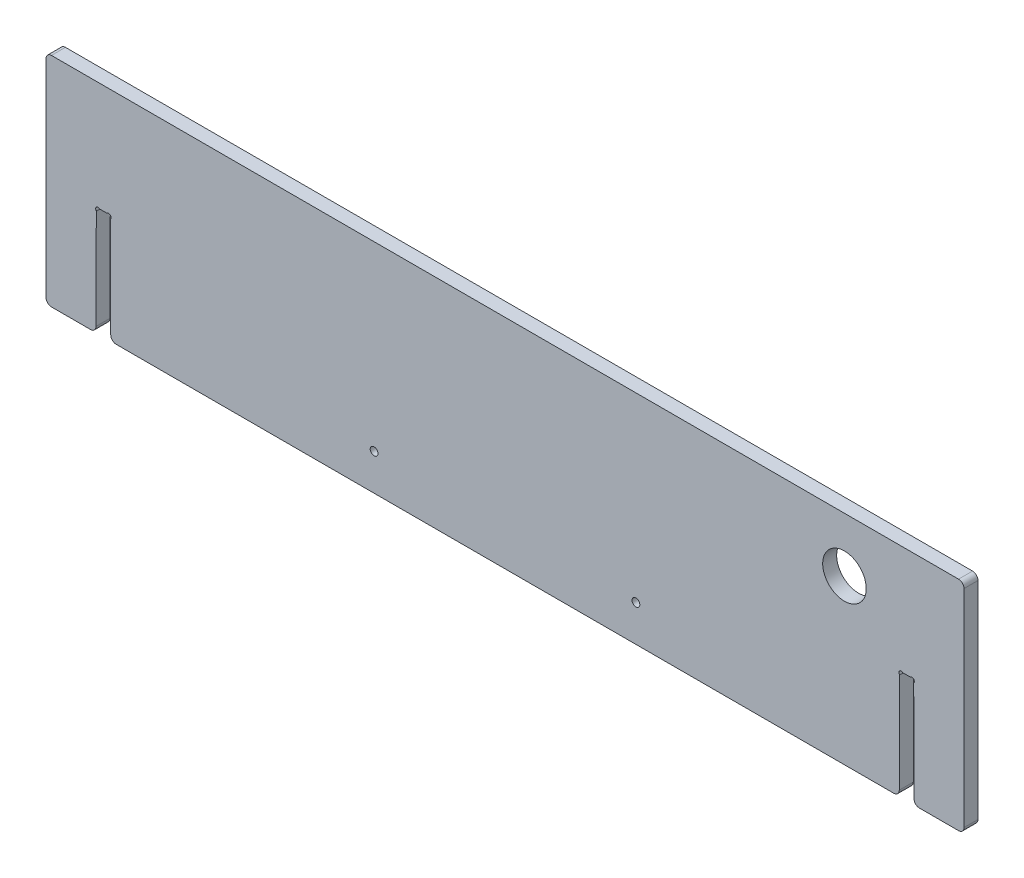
from build123d import *

# Parameters (mm, degrees)
ESQUISSE1_W         = 590.5
ESQUISSE1_H         = 280.25
BOSS_EXTRUDE1_DEPTH = 18
CUT_EXTRUDE1_DEPTH  = 654.876374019
ESQUISSE3_R         = 5
CUT_EXTRUDE2_DEPTH  = 654.876374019
CONG_1_R            = 7
SKETCH1_R           = 28
CUT_EXTRUDE3_DEPTH  = 1214.929595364


with BuildPart() as part:
    # Esquisse1 → Boss-Extrude1 (new body)
    with BuildSketch(Plane.XY):
        with Locations((295.25, 140.125)):
            Rectangle(ESQUISSE1_W, ESQUISSE1_H)
    extrude(amount=BOSS_EXTRUDE1_DEPTH)

    # Esquisse2 → Cut-Extrude1 (cut, through all)
    with BuildSketch(Plane.XY.offset(18)):
        with BuildLine():
            Line((69.477649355, 140.125), (78.147350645, 140.125))
            ThreePointArc((78.147350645, 140.125), (78.480108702, 140.181987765), (78.774940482, 140.346455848))
            ThreePointArc((78.774940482, 140.346455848), (82.906698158, 140.130786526), (83.144207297, 136.00022674))
            ThreePointArc((83.144207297, 136.00022674), (82.981699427, 135.705678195), (82.926062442, 135.373906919))
            Line((82.926062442, 135.373906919), (83.3125, 0))
            Line((83.3125, 0), (64.3125, 0))
            Line((64.3125, 0), (64.698937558, 135.373906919))
            ThreePointArc((64.698937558, 135.373906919), (64.643300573, 135.705678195), (64.480792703, 136.00022674))
            ThreePointArc((64.480792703, 136.00022674), (64.718301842, 140.130786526), (68.850059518, 140.346455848))
            ThreePointArc((68.850059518, 140.346455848), (69.144891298, 140.181987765), (69.477649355, 140.125))
        make_face()
    extrude(amount=-CUT_EXTRUDE1_DEPTH, mode=Mode.SUBTRACT)

    # Esquisse3 → Cut-Extrude2 (cut, through all)
    with BuildSketch(Plane.XY.offset(18)):
        with Locations((422.0625, 46.708333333)):
            Circle(ESQUISSE3_R)
    extrude(amount=-CUT_EXTRUDE2_DEPTH, mode=Mode.SUBTRACT)

    # Cong_1
    cong_1_edges = [part.edges().sort_by_distance(p)[0] for p in [
        (83.3125, 0, 9),
        (64.3125, 0, 9),
        (0, 280.25, 9),
        (0, 0, 9),
    ]]
    fillet(cong_1_edges, radius=CONG_1_R)

    # Sym_trie1: part across plane


with BuildPart() as part_1:
    add(part.part)
    add(part.part.mirror(Plane(origin=(590.5, 0, 18), x_dir=(0, 0, 1), z_dir=(-1, 0, 0))))

    # Sketch1 → Cut-Extrude3 (cut, through all)
    with BuildSketch(Plane.XY.offset(18)):
        with Locations((1027.1875, 210.25)):
            Circle(SKETCH1_R)
    extrude(amount=-CUT_EXTRUDE3_DEPTH, mode=Mode.SUBTRACT)


solid = part_1.part
